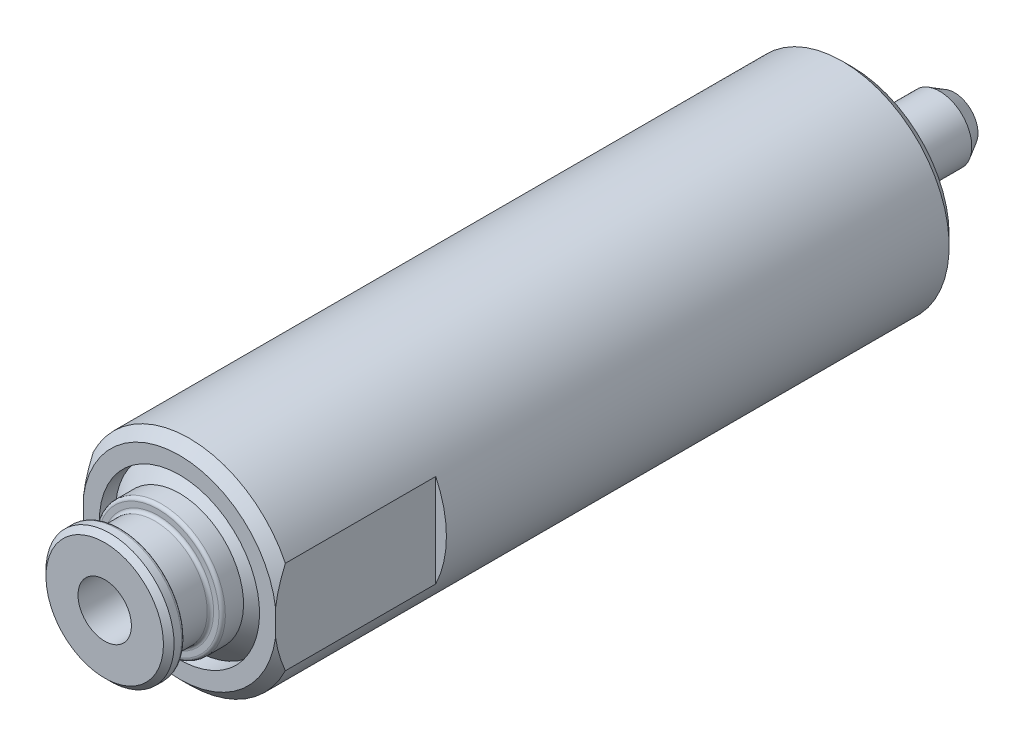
ISO-10303-21;
HEADER;
FILE_DESCRIPTION(('STEP AP214'),'2;1');
FILE_NAME('part.step','',(''),(''),'','','');
FILE_SCHEMA(('AUTOMOTIVE_DESIGN { 1 0 10303 214 1 1 1 1 }'));
ENDSEC;
DATA;
#1=APPLICATION_CONTEXT('core data for automotive mechanical design processes');
#2=APPLICATION_PROTOCOL_DEFINITION('international standard','automotive_design',2000,#1);
#3=PRODUCT_CONTEXT('',#1,'mechanical');
#4=PRODUCT('Part','Part','',(#3));
#5=PRODUCT_RELATED_PRODUCT_CATEGORY('part','',(#4));
#6=PRODUCT_DEFINITION_FORMATION('','',#4);
#7=PRODUCT_DEFINITION_CONTEXT('part definition',#1,'design');
#8=PRODUCT_DEFINITION('design','',#6,#7);
#9=PRODUCT_DEFINITION_SHAPE('','',#8);
#10=(LENGTH_UNIT() NAMED_UNIT(*) SI_UNIT(.MILLI.,.METRE.));
#11=(NAMED_UNIT(*) PLANE_ANGLE_UNIT() SI_UNIT($,.RADIAN.));
#12=(NAMED_UNIT(*) SI_UNIT($,.STERADIAN.) SOLID_ANGLE_UNIT());
#13=UNCERTAINTY_MEASURE_WITH_UNIT(LENGTH_MEASURE(1.E-05),#10,'distance_accuracy_value','');
#14=(GEOMETRIC_REPRESENTATION_CONTEXT(3) GLOBAL_UNCERTAINTY_ASSIGNED_CONTEXT((#13)) GLOBAL_UNIT_ASSIGNED_CONTEXT((#10,
#11,#12)) REPRESENTATION_CONTEXT('',''));
#15=CARTESIAN_POINT('',(0.,0.,0.));
#16=DIRECTION('',(0.,0.,1.));
#17=DIRECTION('',(1.,0.,0.));
#18=AXIS2_PLACEMENT_3D('',#15,#16,#17);
#19=CARTESIAN_POINT('',(0.,0.,3.));
#20=DIRECTION('',(0.,0.,-1.));
#21=DIRECTION('',(-0.500513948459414,-0.865728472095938,0.));
#22=AXIS2_PLACEMENT_3D('',#19,#20,#21);
#23=CYLINDRICAL_SURFACE('',#22,3.);
#24=CARTESIAN_POINT('',(0.,0.,-8.2));
#25=DIRECTION('',(0.,0.,1.));
#26=DIRECTION('',(0.500513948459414,0.865728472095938,0.));
#27=AXIS2_PLACEMENT_3D('',#24,#25,#26);
#28=CIRCLE('',#27,3.);
#29=CARTESIAN_POINT('',(1.50154184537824,2.59718541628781,-8.2));
#30=VERTEX_POINT('',#29);
#31=EDGE_CURVE('E23',#30,#30,#28,.T.);
#32=ORIENTED_EDGE('',*,*,#31,.T.);
#33=EDGE_LOOP('',(#32));
#34=FACE_BOUND('',#33,.T.);
#35=CARTESIAN_POINT('',(0.,0.,0.));
#36=DIRECTION('',(0.,0.,1.));
#37=DIRECTION('',(0.500513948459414,0.865728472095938,0.));
#38=AXIS2_PLACEMENT_3D('',#35,#36,#37);
#39=CIRCLE('',#38,3.);
#40=CARTESIAN_POINT('',(1.50154184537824,2.59718541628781,0.));
#41=VERTEX_POINT('',#40);
#42=EDGE_CURVE('E108',#41,#41,#39,.T.);
#43=ORIENTED_EDGE('',*,*,#42,.F.);
#44=EDGE_LOOP('',(#43));
#45=FACE_BOUND('',#44,.T.);
#46=ADVANCED_FACE('F14',(#34,#45),#23,.T.);
#47=CARTESIAN_POINT('',(0.,0.,-4.));
#48=DIRECTION('',(0.,0.,-1.));
#49=DIRECTION('',(-0.500513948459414,-0.865728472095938,0.));
#50=AXIS2_PLACEMENT_3D('',#47,#48,#49);
#51=SPHERICAL_SURFACE('',#50,6.);
#52=CARTESIAN_POINT('',(0.,0.,-9.58107460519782));
#53=DIRECTION('',(0.,0.,-1.));
#54=DIRECTION('',(-0.865728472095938,0.500513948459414,0.));
#55=AXIS2_PLACEMENT_3D('',#52,#53,#54);
#56=CIRCLE('',#55,2.20263620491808);
#57=CARTESIAN_POINT('',(-1.90688487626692,1.10245014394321,-9.58107460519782));
#58=VERTEX_POINT('',#57);
#59=EDGE_CURVE('E9',#58,#58,#56,.T.);
#60=ORIENTED_EDGE('',*,*,#59,.T.);
#61=EDGE_LOOP('',(#60));
#62=FACE_BOUND('',#61,.T.);
#63=ADVANCED_FACE('F233',(#62),#51,.T.);
#64=CARTESIAN_POINT('',(0.,0.,-8.2));
#65=DIRECTION('',(0.,0.,1.));
#66=DIRECTION('',(0.865728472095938,-0.500513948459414,0.));
#67=AXIS2_PLACEMENT_3D('',#64,#65,#66);
#68=CONICAL_SURFACE('',#67,3.,0.523598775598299);
#69=ORIENTED_EDGE('',*,*,#59,.F.);
#70=EDGE_LOOP('',(#69));
#71=FACE_BOUND('',#70,.T.);
#72=ORIENTED_EDGE('',*,*,#31,.F.);
#73=EDGE_LOOP('',(#72));
#74=FACE_BOUND('',#73,.T.);
#75=ADVANCED_FACE('F222',(#71,#74),#68,.T.);
#76=CARTESIAN_POINT('',(2.067,0.,70.));
#77=DIRECTION('',(0.,0.,-1.));
#78=DIRECTION('',(0.,1.,0.));
#79=AXIS2_PLACEMENT_3D('',#76,#77,#78);
#80=PLANE('',#79);
#81=CARTESIAN_POINT('',(0.,0.,70.));
#82=DIRECTION('',(0.,0.,1.));
#83=DIRECTION('',(1.,0.,0.));
#84=AXIS2_PLACEMENT_3D('',#81,#82,#83);
#85=CIRCLE('',#84,2.5);
#86=CARTESIAN_POINT('',(2.5,0.,70.));
#87=VERTEX_POINT('',#86);
#88=EDGE_CURVE('E252',#87,#87,#85,.T.);
#89=ORIENTED_EDGE('',*,*,#88,.F.);
#90=EDGE_LOOP('',(#89));
#91=FACE_BOUND('',#90,.T.);
#92=CARTESIAN_POINT('',(0.,0.,70.));
#93=DIRECTION('',(0.,0.,-1.));
#94=DIRECTION('',(0.,1.,0.));
#95=AXIS2_PLACEMENT_3D('',#92,#93,#94);
#96=CIRCLE('',#95,5.5);
#97=CARTESIAN_POINT('',(0.,5.5,70.));
#98=VERTEX_POINT('',#97);
#99=EDGE_CURVE('E154',#98,#98,#96,.T.);
#100=ORIENTED_EDGE('',*,*,#99,.F.);
#101=EDGE_LOOP('',(#100));
#102=FACE_BOUND('',#101,.T.);
#103=ADVANCED_FACE('F212',(#91,#102),#80,.F.);
#104=CARTESIAN_POINT('',(0.,0.,70.));
#105=DIRECTION('',(0.,0.,-1.));
#106=DIRECTION('',(0.,1.,0.));
#107=AXIS2_PLACEMENT_3D('',#104,#105,#106);
#108=CONICAL_SURFACE('',#107,5.5,0.785398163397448);
#109=CARTESIAN_POINT('',(0.,0.,69.5));
#110=DIRECTION('',(0.,0.,-1.));
#111=DIRECTION('',(0.,1.,0.));
#112=AXIS2_PLACEMENT_3D('',#109,#110,#111);
#113=CIRCLE('',#112,6.);
#114=CARTESIAN_POINT('',(0.,6.,69.5));
#115=VERTEX_POINT('',#114);
#116=EDGE_CURVE('E151',#115,#115,#113,.T.);
#117=ORIENTED_EDGE('',*,*,#116,.F.);
#118=EDGE_LOOP('',(#117));
#119=FACE_BOUND('',#118,.T.);
#120=ORIENTED_EDGE('',*,*,#99,.T.);
#121=EDGE_LOOP('',(#120));
#122=FACE_BOUND('',#121,.T.);
#123=ADVANCED_FACE('F221',(#119,#122),#108,.T.);
#124=CARTESIAN_POINT('',(0.,0.,47.5));
#125=DIRECTION('',(0.,0.,-1.));
#126=DIRECTION('',(0.,1.,0.));
#127=AXIS2_PLACEMENT_3D('',#124,#125,#126);
#128=CYLINDRICAL_SURFACE('',#127,6.);
#129=CARTESIAN_POINT('',(0.,0.,68.8));
#130=DIRECTION('',(0.,0.,-1.));
#131=DIRECTION('',(0.,1.,0.));
#132=AXIS2_PLACEMENT_3D('',#129,#130,#131);
#133=CIRCLE('',#132,6.);
#134=CARTESIAN_POINT('',(0.,6.,68.8));
#135=VERTEX_POINT('',#134);
#136=EDGE_CURVE('E148',#135,#135,#133,.T.);
#137=ORIENTED_EDGE('',*,*,#136,.F.);
#138=EDGE_LOOP('',(#137));
#139=FACE_BOUND('',#138,.T.);
#140=ORIENTED_EDGE('',*,*,#116,.T.);
#141=EDGE_LOOP('',(#140));
#142=FACE_BOUND('',#141,.T.);
#143=ADVANCED_FACE('F230',(#139,#142),#128,.T.);
#144=CARTESIAN_POINT('',(0.,0.,68.8));
#145=DIRECTION('',(0.,0.,-1.));
#146=DIRECTION('',(0.,1.,0.));
#147=AXIS2_PLACEMENT_3D('',#144,#145,#146);
#148=TOROIDAL_SURFACE('',#147,5.7,0.299999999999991);
#149=ORIENTED_EDGE('',*,*,#136,.T.);
#150=EDGE_LOOP('',(#149));
#151=FACE_BOUND('',#150,.T.);
#152=CARTESIAN_POINT('',(0.,0.,68.5));
#153=DIRECTION('',(0.,0.,-1.));
#154=DIRECTION('',(0.,1.,0.));
#155=AXIS2_PLACEMENT_3D('',#152,#153,#154);
#156=CIRCLE('',#155,5.7);
#157=CARTESIAN_POINT('',(0.,5.7,68.5));
#158=VERTEX_POINT('',#157);
#159=EDGE_CURVE('E145',#158,#158,#156,.T.);
#160=ORIENTED_EDGE('',*,*,#159,.F.);
#161=EDGE_LOOP('',(#160));
#162=FACE_BOUND('',#161,.T.);
#163=ADVANCED_FACE('F296',(#151,#162),#148,.T.);
#164=CARTESIAN_POINT('',(5.7,0.,68.5));
#165=DIRECTION('',(0.,0.,1.));
#166=DIRECTION('',(0.,-1.,0.));
#167=AXIS2_PLACEMENT_3D('',#164,#165,#166);
#168=PLANE('',#167);
#169=CARTESIAN_POINT('',(0.,0.,68.5));
#170=DIRECTION('',(0.,0.,-1.));
#171=DIRECTION('',(0.,1.,0.));
#172=AXIS2_PLACEMENT_3D('',#169,#170,#171);
#173=CIRCLE('',#172,5.2);
#174=CARTESIAN_POINT('',(0.,5.2,68.5));
#175=VERTEX_POINT('',#174);
#176=EDGE_CURVE('E142',#175,#175,#173,.T.);
#177=ORIENTED_EDGE('',*,*,#176,.F.);
#178=EDGE_LOOP('',(#177));
#179=FACE_BOUND('',#178,.T.);
#180=ORIENTED_EDGE('',*,*,#159,.T.);
#181=EDGE_LOOP('',(#180));
#182=FACE_BOUND('',#181,.T.);
#183=ADVANCED_FACE('F292',(#179,#182),#168,.F.);
#184=CARTESIAN_POINT('',(0.,0.,68.2));
#185=DIRECTION('',(0.,0.,-1.));
#186=DIRECTION('',(0.,1.,0.));
#187=AXIS2_PLACEMENT_3D('',#184,#185,#186);
#188=TOROIDAL_SURFACE('',#187,5.2,0.300000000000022);
#189=CARTESIAN_POINT('',(0.,0.,68.2));
#190=DIRECTION('',(0.,0.,-1.));
#191=DIRECTION('',(0.,1.,0.));
#192=AXIS2_PLACEMENT_3D('',#189,#190,#191);
#193=CIRCLE('',#192,4.9);
#194=CARTESIAN_POINT('',(0.,4.9,68.2));
#195=VERTEX_POINT('',#194);
#196=EDGE_CURVE('E139',#195,#195,#193,.T.);
#197=ORIENTED_EDGE('',*,*,#196,.F.);
#198=EDGE_LOOP('',(#197));
#199=FACE_BOUND('',#198,.T.);
#200=ORIENTED_EDGE('',*,*,#176,.T.);
#201=EDGE_LOOP('',(#200));
#202=FACE_BOUND('',#201,.T.);
#203=ADVANCED_FACE('F288',(#199,#202),#188,.F.);
#204=CARTESIAN_POINT('',(0.,0.,47.5));
#205=DIRECTION('',(0.,0.,-1.));
#206=DIRECTION('',(0.,1.,0.));
#207=AXIS2_PLACEMENT_3D('',#204,#205,#206);
#208=CYLINDRICAL_SURFACE('',#207,4.9);
#209=CARTESIAN_POINT('',(0.,0.,65.3));
#210=DIRECTION('',(0.,0.,-1.));
#211=DIRECTION('',(0.,1.,0.));
#212=AXIS2_PLACEMENT_3D('',#209,#210,#211);
#213=CIRCLE('',#212,4.9);
#214=CARTESIAN_POINT('',(0.,4.9,65.3));
#215=VERTEX_POINT('',#214);
#216=EDGE_CURVE('E136',#215,#215,#213,.T.);
#217=ORIENTED_EDGE('',*,*,#216,.F.);
#218=EDGE_LOOP('',(#217));
#219=FACE_BOUND('',#218,.T.);
#220=ORIENTED_EDGE('',*,*,#196,.T.);
#221=EDGE_LOOP('',(#220));
#222=FACE_BOUND('',#221,.T.);
#223=ADVANCED_FACE('F284',(#219,#222),#208,.T.);
#224=CARTESIAN_POINT('',(0.,0.,65.3));
#225=DIRECTION('',(0.,0.,-1.));
#226=DIRECTION('',(0.,1.,0.));
#227=AXIS2_PLACEMENT_3D('',#224,#225,#226);
#228=TOROIDAL_SURFACE('',#227,5.2,0.300000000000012);
#229=CARTESIAN_POINT('',(0.,0.,65.));
#230=DIRECTION('',(0.,0.,-1.));
#231=DIRECTION('',(0.,1.,0.));
#232=AXIS2_PLACEMENT_3D('',#229,#230,#231);
#233=CIRCLE('',#232,5.2);
#234=CARTESIAN_POINT('',(0.,5.2,65.));
#235=VERTEX_POINT('',#234);
#236=EDGE_CURVE('E133',#235,#235,#233,.T.);
#237=ORIENTED_EDGE('',*,*,#236,.F.);
#238=EDGE_LOOP('',(#237));
#239=FACE_BOUND('',#238,.T.);
#240=ORIENTED_EDGE('',*,*,#216,.T.);
#241=EDGE_LOOP('',(#240));
#242=FACE_BOUND('',#241,.T.);
#243=ADVANCED_FACE('F280',(#239,#242),#228,.F.);
#244=CARTESIAN_POINT('',(5.2,0.,65.));
#245=DIRECTION('',(0.,0.,-1.));
#246=DIRECTION('',(0.,1.,0.));
#247=AXIS2_PLACEMENT_3D('',#244,#245,#246);
#248=PLANE('',#247);
#249=CARTESIAN_POINT('',(0.,0.,65.));
#250=DIRECTION('',(0.,0.,-1.));
#251=DIRECTION('',(0.,1.,0.));
#252=AXIS2_PLACEMENT_3D('',#249,#250,#251);
#253=CIRCLE('',#252,5.7);
#254=CARTESIAN_POINT('',(0.,5.7,65.));
#255=VERTEX_POINT('',#254);
#256=EDGE_CURVE('E130',#255,#255,#253,.T.);
#257=ORIENTED_EDGE('',*,*,#256,.F.);
#258=EDGE_LOOP('',(#257));
#259=FACE_BOUND('',#258,.T.);
#260=ORIENTED_EDGE('',*,*,#236,.T.);
#261=EDGE_LOOP('',(#260));
#262=FACE_BOUND('',#261,.T.);
#263=ADVANCED_FACE('F276',(#259,#262),#248,.F.);
#264=CARTESIAN_POINT('',(0.,0.,64.7));
#265=DIRECTION('',(0.,0.,-1.));
#266=DIRECTION('',(0.,1.,0.));
#267=AXIS2_PLACEMENT_3D('',#264,#265,#266);
#268=TOROIDAL_SURFACE('',#267,5.7,0.300000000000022);
#269=ORIENTED_EDGE('',*,*,#256,.T.);
#270=EDGE_LOOP('',(#269));
#271=FACE_BOUND('',#270,.T.);
#272=CARTESIAN_POINT('',(0.,0.,64.7));
#273=DIRECTION('',(0.,0.,-1.));
#274=DIRECTION('',(0.,1.,0.));
#275=AXIS2_PLACEMENT_3D('',#272,#273,#274);
#276=CIRCLE('',#275,6.);
#277=CARTESIAN_POINT('',(0.,6.,64.7));
#278=VERTEX_POINT('',#277);
#279=EDGE_CURVE('E127',#278,#278,#276,.T.);
#280=ORIENTED_EDGE('',*,*,#279,.F.);
#281=EDGE_LOOP('',(#280));
#282=FACE_BOUND('',#281,.T.);
#283=ADVANCED_FACE('F272',(#271,#282),#268,.T.);
#284=CARTESIAN_POINT('',(0.,0.,47.5));
#285=DIRECTION('',(0.,0.,-1.));
#286=DIRECTION('',(0.,1.,0.));
#287=AXIS2_PLACEMENT_3D('',#284,#285,#286);
#288=CYLINDRICAL_SURFACE('',#287,6.);
#289=CARTESIAN_POINT('',(0.,0.,63.));
#290=DIRECTION('',(0.,0.,-1.));
#291=DIRECTION('',(0.,1.,0.));
#292=AXIS2_PLACEMENT_3D('',#289,#290,#291);
#293=CIRCLE('',#292,6.);
#294=CARTESIAN_POINT('',(0.,6.,63.));
#295=VERTEX_POINT('',#294);
#296=EDGE_CURVE('E124',#295,#295,#293,.T.);
#297=ORIENTED_EDGE('',*,*,#296,.F.);
#298=EDGE_LOOP('',(#297));
#299=FACE_BOUND('',#298,.T.);
#300=ORIENTED_EDGE('',*,*,#279,.T.);
#301=EDGE_LOOP('',(#300));
#302=FACE_BOUND('',#301,.T.);
#303=ADVANCED_FACE('F268',(#299,#302),#288,.T.);
#304=CARTESIAN_POINT('',(0.,0.,63.));
#305=DIRECTION('',(0.,0.,-1.));
#306=DIRECTION('',(0.,1.,0.));
#307=AXIS2_PLACEMENT_3D('',#304,#305,#306);
#308=CONICAL_SURFACE('',#307,6.,0.785398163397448);
#309=CARTESIAN_POINT('',(0.,0.,61.5));
#310=DIRECTION('',(0.,0.,-1.));
#311=DIRECTION('',(0.,1.,0.));
#312=AXIS2_PLACEMENT_3D('',#309,#310,#311);
#313=CIRCLE('',#312,7.5);
#314=CARTESIAN_POINT('',(0.,7.5,61.5));
#315=VERTEX_POINT('',#314);
#316=EDGE_CURVE('E121',#315,#315,#313,.T.);
#317=ORIENTED_EDGE('',*,*,#316,.F.);
#318=EDGE_LOOP('',(#317));
#319=FACE_BOUND('',#318,.T.);
#320=ORIENTED_EDGE('',*,*,#296,.T.);
#321=EDGE_LOOP('',(#320));
#322=FACE_BOUND('',#321,.T.);
#323=ADVANCED_FACE('F184',(#319,#322),#308,.T.);
#324=CARTESIAN_POINT('',(0.,0.,0.));
#325=DIRECTION('',(0.,0.,-1.));
#326=DIRECTION('',(0.,1.,0.));
#327=AXIS2_PLACEMENT_3D('',#324,#325,#326);
#328=CYLINDRICAL_SURFACE('',#327,7.5);
#329=ORIENTED_EDGE('',*,*,#316,.T.);
#330=EDGE_LOOP('',(#329));
#331=FACE_BOUND('',#330,.T.);
#332=CARTESIAN_POINT('',(0.,0.,63.));
#333=DIRECTION('',(0.,0.,-1.));
#334=DIRECTION('',(0.,1.,0.));
#335=AXIS2_PLACEMENT_3D('',#332,#333,#334);
#336=CIRCLE('',#335,7.5);
#337=CARTESIAN_POINT('',(0.,7.5,63.));
#338=VERTEX_POINT('',#337);
#339=EDGE_CURVE('E95',#338,#338,#336,.T.);
#340=ORIENTED_EDGE('',*,*,#339,.F.);
#341=EDGE_LOOP('',(#340));
#342=FACE_BOUND('',#341,.T.);
#343=ADVANCED_FACE('F182',(#331,#342),#328,.F.);
#344=CARTESIAN_POINT('',(9.08,0.,63.));
#345=DIRECTION('',(0.,0.,1.));
#346=DIRECTION('',(0.,-1.,0.));
#347=AXIS2_PLACEMENT_3D('',#344,#345,#346);
#348=PLANE('',#347);
#349=ORIENTED_EDGE('',*,*,#339,.T.);
#350=EDGE_LOOP('',(#349));
#351=FACE_BOUND('',#350,.T.);
#352=CARTESIAN_POINT('',(0.,0.,63.));
#353=DIRECTION('',(0.,0.,-1.));
#354=DIRECTION('',(0.,1.,0.));
#355=AXIS2_PLACEMENT_3D('',#352,#353,#354);
#356=CIRCLE('',#355,9.08);
#357=CARTESIAN_POINT('',(-9.,1.20266371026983,63.));
#358=VERTEX_POINT('',#357);
#359=CARTESIAN_POINT('',(9.,1.20266371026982,63.));
#360=VERTEX_POINT('',#359);
#361=EDGE_CURVE('E92',#358,#360,#356,.T.);
#362=ORIENTED_EDGE('',*,*,#361,.F.);
#363=DIRECTION('',(0.,-1.,0.));
#364=VECTOR('',#363,1.);
#365=CARTESIAN_POINT('',(-9.,0.,63.));
#366=LINE('',#365,#364);
#367=CARTESIAN_POINT('',(-9.,-1.20266371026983,63.));
#368=VERTEX_POINT('',#367);
#369=EDGE_CURVE('E78',#358,#368,#366,.T.);
#370=ORIENTED_EDGE('',*,*,#369,.T.);
#371=CARTESIAN_POINT('',(9.,-1.20266371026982,63.));
#372=VERTEX_POINT('',#371);
#373=EDGE_CURVE('E85',#372,#368,#356,.T.);
#374=ORIENTED_EDGE('',*,*,#373,.F.);
#375=DIRECTION('',(0.,1.,0.));
#376=VECTOR('',#375,1.);
#377=CARTESIAN_POINT('',(9.,0.,63.));
#378=LINE('',#377,#376);
#379=EDGE_CURVE('E68',#372,#360,#378,.T.);
#380=ORIENTED_EDGE('',*,*,#379,.T.);
#381=EDGE_LOOP('',(#362,#370,#374,#380));
#382=FACE_BOUND('',#381,.T.);
#383=ADVANCED_FACE('F90',(#351,#382),#348,.T.);
#384=CARTESIAN_POINT('',(0.,0.,62.08));
#385=DIRECTION('',(0.,0.,-1.));
#386=DIRECTION('',(0.,1.,0.));
#387=AXIS2_PLACEMENT_3D('',#384,#385,#386);
#388=CONICAL_SURFACE('',#387,10.,0.785398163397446);
#389=CARTESIAN_POINT('',(0.,0.,62.08));
#390=DIRECTION('',(0.,0.,-1.));
#391=DIRECTION('',(0.,1.,0.));
#392=AXIS2_PLACEMENT_3D('',#389,#390,#391);
#393=CIRCLE('',#392,10.);
#394=CARTESIAN_POINT('',(-9.,4.35889894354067,62.08));
#395=VERTEX_POINT('',#394);
#396=CARTESIAN_POINT('',(9.,4.35889894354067,62.08));
#397=VERTEX_POINT('',#396);
#398=EDGE_CURVE('E91',#395,#397,#393,.T.);
#399=ORIENTED_EDGE('',*,*,#398,.F.);
#400=CARTESIAN_POINT('',(-9.,20.0889844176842,50.0671107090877));
#401=CARTESIAN_POINT('',(-9.,19.7941845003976,50.3361376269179));
#402=CARTESIAN_POINT('',(-9.,19.49889874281,50.6046332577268));
#403=CARTESIAN_POINT('',(-9.,18.9072134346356,51.1403994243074));
#404=CARTESIAN_POINT('',(-9.,18.6108138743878,51.4076699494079));
#405=CARTESIAN_POINT('',(-9.,18.016689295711,51.9408857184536));
#406=CARTESIAN_POINT('',(-9.,17.7189639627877,52.2068306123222));
#407=CARTESIAN_POINT('',(-9.,17.1220890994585,52.7371142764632));
#408=CARTESIAN_POINT('',(-9.,16.822939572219,53.0014530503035));
#409=CARTESIAN_POINT('',(-9.,15.9186985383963,53.7955547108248));
#410=CARTESIAN_POINT('',(-9.,15.3111326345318,54.3225158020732));
#411=CARTESIAN_POINT('',(-9.,14.3932925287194,55.1052669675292));
#412=CARTESIAN_POINT('',(-9.,14.0862824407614,55.3648870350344));
#413=CARTESIAN_POINT('',(-9.,13.4697157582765,55.881088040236));
#414=CARTESIAN_POINT('',(-9.,13.1601591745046,56.1376689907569));
#415=CARTESIAN_POINT('',(-9.,12.5849192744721,56.6088254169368));
#416=CARTESIAN_POINT('',(-9.,12.3196505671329,56.8239068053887));
#417=CARTESIAN_POINT('',(-9.,11.7866455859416,57.2509886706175));
#418=CARTESIAN_POINT('',(-9.,11.5189093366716,57.4629891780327));
#419=CARTESIAN_POINT('',(-9.,10.9804995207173,57.8834133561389));
#420=CARTESIAN_POINT('',(-9.,10.7098250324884,58.0918358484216));
#421=CARTESIAN_POINT('',(-9.,10.165171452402,58.5043204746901));
#422=CARTESIAN_POINT('',(-9.,9.89119239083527,58.7083826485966));
#423=CARTESIAN_POINT('',(-9.,9.33978293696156,59.1109565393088));
#424=CARTESIAN_POINT('',(-9.,9.06235809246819,59.309475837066));
#425=CARTESIAN_POINT('',(-9.,8.50301529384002,59.7001296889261));
#426=CARTESIAN_POINT('',(-9.,8.22109712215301,59.8922639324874));
#427=CARTESIAN_POINT('',(-9.,7.65217834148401,60.2685512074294));
#428=CARTESIAN_POINT('',(-9.,7.36518050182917,60.4527084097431));
#429=CARTESIAN_POINT('',(-9.,6.78513344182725,60.8111918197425));
#430=CARTESIAN_POINT('',(-9.,6.49208508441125,60.9855194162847));
#431=CARTESIAN_POINT('',(-9.,5.90679788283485,61.317393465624));
#432=CARTESIAN_POINT('',(-9.,5.6147426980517,61.4752618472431));
#433=CARTESIAN_POINT('',(-9.,5.02305416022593,61.7763015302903));
#434=CARTESIAN_POINT('',(-9.,4.72342010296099,61.9194714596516));
#435=CARTESIAN_POINT('',(-9.,4.11636189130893,62.1870563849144));
#436=CARTESIAN_POINT('',(-9.,3.80895049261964,62.3115000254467));
#437=CARTESIAN_POINT('',(-9.,3.18569208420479,62.5372331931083));
#438=CARTESIAN_POINT('',(-9.,2.86984745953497,62.6385291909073));
#439=CARTESIAN_POINT('',(-9.,2.29142781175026,62.7962123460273));
#440=CARTESIAN_POINT('',(-9.,2.03019136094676,62.8574808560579));
#441=CARTESIAN_POINT('',(-9.,1.50362674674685,62.958913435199));
#442=CARTESIAN_POINT('',(-9.,1.23829917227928,62.9990805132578));
#443=CARTESIAN_POINT('',(-9.,0.705706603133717,63.0562472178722));
#444=CARTESIAN_POINT('',(-9.,0.438447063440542,63.0732969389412));
#445=CARTESIAN_POINT('',(-9.,-0.0965355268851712,63.0834560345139));
#446=CARTESIAN_POINT('',(-9.,-0.364258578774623,63.0765653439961));
#447=CARTESIAN_POINT('',(-9.,-0.897547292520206,63.03926235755));
#448=CARTESIAN_POINT('',(-9.,-1.16311598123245,63.0088926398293));
#449=CARTESIAN_POINT('',(-9.,-1.69079838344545,62.9262664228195));
#450=CARTESIAN_POINT('',(-9.,-1.9529118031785,62.8740080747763));
#451=CARTESIAN_POINT('',(-9.,-2.47314253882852,62.7498122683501));
#452=CARTESIAN_POINT('',(-9.,-2.73124679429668,62.6778207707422));
#453=CARTESIAN_POINT('',(-9.,-3.24205693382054,62.516938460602));
#454=CARTESIAN_POINT('',(-9.,-3.49476303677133,62.4280483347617));
#455=CARTESIAN_POINT('',(-9.,-4.07604409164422,62.2047542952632));
#456=CARTESIAN_POINT('',(-9.,-4.40253716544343,62.0649539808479));
#457=CARTESIAN_POINT('',(-9.,-5.04645154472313,61.7656734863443));
#458=CARTESIAN_POINT('',(-9.,-5.36386785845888,61.6061827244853));
#459=CARTESIAN_POINT('',(-9.,-5.99110227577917,61.271539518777));
#460=CARTESIAN_POINT('',(-9.,-6.30090358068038,61.0963558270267));
#461=CARTESIAN_POINT('',(-9.,-6.91327229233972,60.7339678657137));
#462=CARTESIAN_POINT('',(-9.,-7.21584094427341,60.5467656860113));
#463=CARTESIAN_POINT('',(-9.,-7.81811190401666,60.1607348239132));
#464=CARTESIAN_POINT('',(-9.,-8.11774682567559,59.961801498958));
#465=CARTESIAN_POINT('',(-9.,-8.71169811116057,59.5561568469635));
#466=CARTESIAN_POINT('',(-9.,-9.00601430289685,59.3494452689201));
#467=CARTESIAN_POINT('',(-9.,-9.58977868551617,58.9299922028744));
#468=CARTESIAN_POINT('',(-9.,-9.87923221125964,58.7172581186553));
#469=CARTESIAN_POINT('',(-9.,-10.4543036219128,58.2866619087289));
#470=CARTESIAN_POINT('',(-9.,-10.7399213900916,58.0687996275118));
#471=CARTESIAN_POINT('',(-9.,-11.4242974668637,57.5386678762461));
#472=CARTESIAN_POINT('',(-9.,-11.8214368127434,57.2243100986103));
#473=CARTESIAN_POINT('',(-9.,-12.6104586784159,56.5890670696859));
#474=CARTESIAN_POINT('',(-9.,-13.0023410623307,56.268181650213));
#475=CARTESIAN_POINT('',(-9.,-13.7819938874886,55.6210793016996));
#476=CARTESIAN_POINT('',(-9.,-14.1697622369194,55.2948598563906));
#477=CARTESIAN_POINT('',(-9.,-14.9417496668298,54.6382482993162));
#478=CARTESIAN_POINT('',(-9.,-15.3259687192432,54.3078561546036));
#479=CARTESIAN_POINT('',(-9.,-16.0783900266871,53.6549933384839));
#480=CARTESIAN_POINT('',(-9.,-16.4466915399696,53.3326369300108));
#481=CARTESIAN_POINT('',(-9.,-17.1809601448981,52.6852740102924));
#482=CARTESIAN_POINT('',(-9.,-17.5469272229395,52.3602674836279));
#483=CARTESIAN_POINT('',(-9.,-18.2765566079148,51.7083120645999));
#484=CARTESIAN_POINT('',(-9.,-18.6402206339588,51.3813650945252));
#485=CARTESIAN_POINT('',(-9.,-19.3658255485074,50.725578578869));
#486=CARTESIAN_POINT('',(-9.,-19.7277664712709,50.3967390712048));
#487=CARTESIAN_POINT('',(-9.,-20.0889844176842,50.0671107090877));
#488=B_SPLINE_CURVE_WITH_KNOTS('',3,(#400,#401,#402,#403,#404,#405,#406,#407,#408,#409,#410,
#411,#412,#413,#414,#415,#416,#417,#418,#419,#420,#421,#422,#423,#424,#425,#426,#427,#428,#429,
#430,#431,#432,#433,#434,#435,#436,#437,#438,#439,#440,#441,#442,#443,#444,#445,#446,#447,#448,
#449,#450,#451,#452,#453,#454,#455,#456,#457,#458,#459,#460,#461,#462,#463,#464,#465,#466,#467,
#468,#469,#470,#471,#472,#473,#474,#475,#476,#477,#478,#479,#480,#481,#482,#483,#484,#485,#486,
#487),.UNSPECIFIED.,.F.,.F.,(4,2,2,2,2,2,2,2,2,2,2,2,2,2,2,2,2,2,2,2,2,2,2,2,2,2,2,2,2,2,2,2,2,
2,2,2,2,2,2,2,2,2,2,4),(0.,1.19730659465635,2.3946235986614,3.59224161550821,4.78985697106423,
7.20251667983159,8.40870278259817,9.61488379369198,10.6393878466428,11.6638817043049,
12.6887067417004,13.7135223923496,14.7368599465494,15.7602471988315,16.7830927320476,
17.8057933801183,18.8014398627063,19.7971792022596,20.7913795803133,21.7853016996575,
22.5895213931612,23.3936263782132,24.195986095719,24.9983479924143,25.7992582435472,
26.6002361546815,27.4034298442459,28.2065909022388,29.2712072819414,30.3363983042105,
31.403759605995,32.4709358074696,33.5497661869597,34.6286314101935,35.7062234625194,
36.7838482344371,38.3032478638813,39.8226866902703,41.3428642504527,42.8630538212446,
44.3313839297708,45.7997225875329,47.2667917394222,48.7338316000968),.UNSPECIFIED.);
#489=EDGE_CURVE('E199',#395,#358,#488,.T.);
#490=ORIENTED_EDGE('',*,*,#489,.T.);
#491=ORIENTED_EDGE('',*,*,#361,.T.);
#492=CARTESIAN_POINT('',(9.,-20.0889844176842,50.0671107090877));
#493=CARTESIAN_POINT('',(9.,-19.7941845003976,50.3361376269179));
#494=CARTESIAN_POINT('',(9.,-19.49889874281,50.6046332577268));
#495=CARTESIAN_POINT('',(9.,-18.9072134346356,51.1403994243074));
#496=CARTESIAN_POINT('',(9.,-18.6108138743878,51.4076699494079));
#497=CARTESIAN_POINT('',(9.,-18.016689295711,51.9408857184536));
#498=CARTESIAN_POINT('',(9.,-17.7189639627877,52.2068306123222));
#499=CARTESIAN_POINT('',(9.,-17.1220890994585,52.7371142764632));
#500=CARTESIAN_POINT('',(9.,-16.822939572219,53.0014530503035));
#501=CARTESIAN_POINT('',(9.,-15.9186985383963,53.7955547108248));
#502=CARTESIAN_POINT('',(9.,-15.3111326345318,54.3225158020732));
#503=CARTESIAN_POINT('',(9.,-14.3932925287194,55.1052669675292));
#504=CARTESIAN_POINT('',(9.,-14.0862824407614,55.3648870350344));
#505=CARTESIAN_POINT('',(9.,-13.4697157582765,55.881088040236));
#506=CARTESIAN_POINT('',(9.,-13.1601591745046,56.1376689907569));
#507=CARTESIAN_POINT('',(9.,-12.5849192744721,56.6088254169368));
#508=CARTESIAN_POINT('',(9.,-12.3196505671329,56.8239068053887));
#509=CARTESIAN_POINT('',(9.,-11.7866455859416,57.2509886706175));
#510=CARTESIAN_POINT('',(9.,-11.5189093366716,57.4629891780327));
#511=CARTESIAN_POINT('',(9.,-10.9804995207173,57.8834133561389));
#512=CARTESIAN_POINT('',(9.,-10.7098250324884,58.0918358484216));
#513=CARTESIAN_POINT('',(9.,-10.165171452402,58.5043204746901));
#514=CARTESIAN_POINT('',(9.,-9.89119239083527,58.7083826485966));
#515=CARTESIAN_POINT('',(9.,-9.33978293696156,59.1109565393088));
#516=CARTESIAN_POINT('',(9.,-9.06235809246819,59.309475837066));
#517=CARTESIAN_POINT('',(9.,-8.50301529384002,59.7001296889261));
#518=CARTESIAN_POINT('',(9.,-8.22109712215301,59.8922639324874));
#519=CARTESIAN_POINT('',(9.,-7.65217834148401,60.2685512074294));
#520=CARTESIAN_POINT('',(9.,-7.36518050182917,60.4527084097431));
#521=CARTESIAN_POINT('',(9.,-6.78513344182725,60.8111918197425));
#522=CARTESIAN_POINT('',(9.,-6.49208508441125,60.9855194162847));
#523=CARTESIAN_POINT('',(9.,-5.90679788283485,61.317393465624));
#524=CARTESIAN_POINT('',(9.,-5.6147426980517,61.4752618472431));
#525=CARTESIAN_POINT('',(9.,-5.02305416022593,61.7763015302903));
#526=CARTESIAN_POINT('',(9.,-4.72342010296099,61.9194714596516));
#527=CARTESIAN_POINT('',(9.,-4.11636189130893,62.1870563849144));
#528=CARTESIAN_POINT('',(9.,-3.80895049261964,62.3115000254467));
#529=CARTESIAN_POINT('',(9.,-3.18569208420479,62.5372331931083));
#530=CARTESIAN_POINT('',(9.,-2.86984745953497,62.6385291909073));
#531=CARTESIAN_POINT('',(9.,-2.29142781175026,62.7962123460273));
#532=CARTESIAN_POINT('',(9.,-2.03019136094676,62.8574808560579));
#533=CARTESIAN_POINT('',(9.,-1.50362674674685,62.958913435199));
#534=CARTESIAN_POINT('',(9.,-1.23829917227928,62.9990805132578));
#535=CARTESIAN_POINT('',(9.,-0.705706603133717,63.0562472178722));
#536=CARTESIAN_POINT('',(9.,-0.438447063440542,63.0732969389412));
#537=CARTESIAN_POINT('',(9.,0.0965355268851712,63.0834560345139));
#538=CARTESIAN_POINT('',(9.,0.364258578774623,63.0765653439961));
#539=CARTESIAN_POINT('',(9.,0.897547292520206,63.03926235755));
#540=CARTESIAN_POINT('',(9.,1.16311598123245,63.0088926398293));
#541=CARTESIAN_POINT('',(9.,1.69079838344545,62.9262664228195));
#542=CARTESIAN_POINT('',(9.,1.9529118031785,62.8740080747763));
#543=CARTESIAN_POINT('',(9.,2.47314253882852,62.7498122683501));
#544=CARTESIAN_POINT('',(9.,2.73124679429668,62.6778207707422));
#545=CARTESIAN_POINT('',(9.,3.24205693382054,62.516938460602));
#546=CARTESIAN_POINT('',(9.,3.49476303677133,62.4280483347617));
#547=CARTESIAN_POINT('',(9.,4.07604409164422,62.2047542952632));
#548=CARTESIAN_POINT('',(9.,4.40253716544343,62.0649539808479));
#549=CARTESIAN_POINT('',(9.,5.04645154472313,61.7656734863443));
#550=CARTESIAN_POINT('',(9.,5.36386785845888,61.6061827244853));
#551=CARTESIAN_POINT('',(9.,5.99110227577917,61.271539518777));
#552=CARTESIAN_POINT('',(9.,6.30090358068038,61.0963558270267));
#553=CARTESIAN_POINT('',(9.,6.91327229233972,60.7339678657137));
#554=CARTESIAN_POINT('',(9.,7.21584094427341,60.5467656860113));
#555=CARTESIAN_POINT('',(9.,7.81811190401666,60.1607348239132));
#556=CARTESIAN_POINT('',(9.,8.11774682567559,59.961801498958));
#557=CARTESIAN_POINT('',(9.,8.71169811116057,59.5561568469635));
#558=CARTESIAN_POINT('',(9.,9.00601430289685,59.3494452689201));
#559=CARTESIAN_POINT('',(9.,9.58977868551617,58.9299922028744));
#560=CARTESIAN_POINT('',(9.,9.87923221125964,58.7172581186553));
#561=CARTESIAN_POINT('',(9.,10.4543036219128,58.2866619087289));
#562=CARTESIAN_POINT('',(9.,10.7399213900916,58.0687996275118));
#563=CARTESIAN_POINT('',(9.,11.4242974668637,57.5386678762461));
#564=CARTESIAN_POINT('',(9.,11.8214368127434,57.2243100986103));
#565=CARTESIAN_POINT('',(9.,12.6104586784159,56.5890670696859));
#566=CARTESIAN_POINT('',(9.,13.0023410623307,56.268181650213));
#567=CARTESIAN_POINT('',(9.,13.7819938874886,55.6210793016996));
#568=CARTESIAN_POINT('',(9.,14.1697622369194,55.2948598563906));
#569=CARTESIAN_POINT('',(9.,14.9417496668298,54.6382482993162));
#570=CARTESIAN_POINT('',(9.,15.3259687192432,54.3078561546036));
#571=CARTESIAN_POINT('',(9.,16.0783900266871,53.6549933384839));
#572=CARTESIAN_POINT('',(9.,16.4466915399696,53.3326369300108));
#573=CARTESIAN_POINT('',(9.,17.1809601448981,52.6852740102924));
#574=CARTESIAN_POINT('',(9.,17.5469272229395,52.3602674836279));
#575=CARTESIAN_POINT('',(9.,18.2765566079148,51.7083120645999));
#576=CARTESIAN_POINT('',(9.,18.6402206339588,51.3813650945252));
#577=CARTESIAN_POINT('',(9.,19.3658255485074,50.725578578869));
#578=CARTESIAN_POINT('',(9.,19.7277664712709,50.3967390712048));
#579=CARTESIAN_POINT('',(9.,20.0889844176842,50.0671107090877));
#580=B_SPLINE_CURVE_WITH_KNOTS('',3,(#492,#493,#494,#495,#496,#497,#498,#499,#500,#501,#502,
#503,#504,#505,#506,#507,#508,#509,#510,#511,#512,#513,#514,#515,#516,#517,#518,#519,#520,#521,
#522,#523,#524,#525,#526,#527,#528,#529,#530,#531,#532,#533,#534,#535,#536,#537,#538,#539,#540,
#541,#542,#543,#544,#545,#546,#547,#548,#549,#550,#551,#552,#553,#554,#555,#556,#557,#558,#559,
#560,#561,#562,#563,#564,#565,#566,#567,#568,#569,#570,#571,#572,#573,#574,#575,#576,#577,#578,
#579),.UNSPECIFIED.,.F.,.F.,(4,2,2,2,2,2,2,2,2,2,2,2,2,2,2,2,2,2,2,2,2,2,2,2,2,2,2,2,2,2,2,2,2,
2,2,2,2,2,2,2,2,2,2,4),(0.,1.19730659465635,2.3946235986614,3.59224161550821,4.78985697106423,
7.20251667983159,8.40870278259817,9.61488379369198,10.6393878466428,11.6638817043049,
12.6887067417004,13.7135223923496,14.7368599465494,15.7602471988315,16.7830927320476,
17.8057933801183,18.8014398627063,19.7971792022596,20.7913795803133,21.7853016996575,
22.5895213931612,23.3936263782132,24.195986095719,24.9983479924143,25.7992582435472,
26.6002361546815,27.4034298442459,28.2065909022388,29.2712072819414,30.3363983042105,
31.403759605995,32.4709358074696,33.5497661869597,34.6286314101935,35.7062234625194,
36.7838482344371,38.3032478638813,39.8226866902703,41.3428642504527,42.8630538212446,
44.3313839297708,45.7997225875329,47.2667917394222,48.7338316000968),.UNSPECIFIED.);
#581=EDGE_CURVE('E31',#360,#397,#580,.T.);
#582=ORIENTED_EDGE('',*,*,#581,.T.);
#583=EDGE_LOOP('',(#399,#490,#491,#582));
#584=FACE_BOUND('',#583,.T.);
#585=ADVANCED_FACE('F169',(#584),#388,.T.);
#586=CARTESIAN_POINT('',(0.,0.,48.));
#587=DIRECTION('',(0.,0.,1.));
#588=DIRECTION('',(0.,-1.,0.));
#589=AXIS2_PLACEMENT_3D('',#586,#587,#588);
#590=PLANE('',#589);
#591=DIRECTION('',(0.,-1.,0.));
#592=VECTOR('',#591,1.);
#593=CARTESIAN_POINT('',(-9.,10.,48.));
#594=LINE('',#593,#592);
#595=CARTESIAN_POINT('',(-9.,4.35889894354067,48.));
#596=VERTEX_POINT('',#595);
#597=CARTESIAN_POINT('',(-9.,-4.35889894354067,48.));
#598=VERTEX_POINT('',#597);
#599=EDGE_CURVE('E159',#596,#598,#594,.T.);
#600=ORIENTED_EDGE('',*,*,#599,.F.);
#601=CARTESIAN_POINT('',(0.,0.,48.));
#602=DIRECTION('',(0.,0.,1.));
#603=DIRECTION('',(0.,-1.,0.));
#604=AXIS2_PLACEMENT_3D('',#601,#602,#603);
#605=CIRCLE('',#604,10.);
#606=EDGE_CURVE('E104',#598,#596,#605,.F.);
#607=ORIENTED_EDGE('',*,*,#606,.F.);
#608=EDGE_LOOP('',(#600,#607));
#609=FACE_BOUND('',#608,.T.);
#610=ADVANCED_FACE('F193',(#609),#590,.T.);
#611=CARTESIAN_POINT('',(-9.,10.,48.));
#612=DIRECTION('',(-1.,0.,0.));
#613=DIRECTION('',(0.,-1.,0.));
#614=AXIS2_PLACEMENT_3D('',#611,#612,#613);
#615=PLANE('',#614);
#616=ORIENTED_EDGE('',*,*,#599,.T.);
#617=DIRECTION('',(0.,0.,-1.));
#618=VECTOR('',#617,1.);
#619=CARTESIAN_POINT('',(-9.,-4.35889894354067,0.));
#620=LINE('',#619,#618);
#621=CARTESIAN_POINT('',(-9.,-4.35889894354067,62.08));
#622=VERTEX_POINT('',#621);
#623=EDGE_CURVE('E202',#622,#598,#620,.T.);
#624=ORIENTED_EDGE('',*,*,#623,.F.);
#625=EDGE_CURVE('E39',#368,#622,#488,.T.);
#626=ORIENTED_EDGE('',*,*,#625,.F.);
#627=ORIENTED_EDGE('',*,*,#369,.F.);
#628=ORIENTED_EDGE('',*,*,#489,.F.);
#629=DIRECTION('',(0.,0.,-1.));
#630=VECTOR('',#629,1.);
#631=CARTESIAN_POINT('',(-9.,4.35889894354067,0.));
#632=LINE('',#631,#630);
#633=EDGE_CURVE('E198',#596,#395,#632,.F.);
#634=ORIENTED_EDGE('',*,*,#633,.F.);
#635=EDGE_LOOP('',(#616,#624,#626,#627,#628,#634));
#636=FACE_BOUND('',#635,.T.);
#637=ADVANCED_FACE('F179',(#636),#615,.T.);
#638=ORIENTED_EDGE('',*,*,#373,.T.);
#639=ORIENTED_EDGE('',*,*,#625,.T.);
#640=CARTESIAN_POINT('',(9.,-4.35889894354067,62.08));
#641=VERTEX_POINT('',#640);
#642=EDGE_CURVE('E86',#641,#622,#393,.T.);
#643=ORIENTED_EDGE('',*,*,#642,.F.);
#644=EDGE_CURVE('E72',#641,#372,#580,.T.);
#645=ORIENTED_EDGE('',*,*,#644,.T.);
#646=EDGE_LOOP('',(#638,#639,#643,#645));
#647=FACE_BOUND('',#646,.T.);
#648=ADVANCED_FACE('F84',(#647),#388,.T.);
#649=DIRECTION('',(0.,1.,0.));
#650=VECTOR('',#649,1.);
#651=CARTESIAN_POINT('',(9.,-10.,48.));
#652=LINE('',#651,#650);
#653=CARTESIAN_POINT('',(9.,-4.35889894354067,48.));
#654=VERTEX_POINT('',#653);
#655=CARTESIAN_POINT('',(9.,4.35889894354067,48.));
#656=VERTEX_POINT('',#655);
#657=EDGE_CURVE('E157',#654,#656,#652,.T.);
#658=ORIENTED_EDGE('',*,*,#657,.F.);
#659=EDGE_CURVE('E18',#656,#654,#605,.F.);
#660=ORIENTED_EDGE('',*,*,#659,.F.);
#661=EDGE_LOOP('',(#658,#660));
#662=FACE_BOUND('',#661,.T.);
#663=ADVANCED_FACE('F178',(#662),#590,.T.);
#664=CARTESIAN_POINT('',(9.,-10.,48.));
#665=DIRECTION('',(1.,0.,0.));
#666=DIRECTION('',(0.,1.,0.));
#667=AXIS2_PLACEMENT_3D('',#664,#665,#666);
#668=PLANE('',#667);
#669=ORIENTED_EDGE('',*,*,#657,.T.);
#670=DIRECTION('',(0.,0.,-1.));
#671=VECTOR('',#670,1.);
#672=CARTESIAN_POINT('',(9.,4.35889894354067,0.));
#673=LINE('',#672,#671);
#674=EDGE_CURVE('E88',#397,#656,#673,.T.);
#675=ORIENTED_EDGE('',*,*,#674,.F.);
#676=ORIENTED_EDGE('',*,*,#581,.F.);
#677=ORIENTED_EDGE('',*,*,#379,.F.);
#678=ORIENTED_EDGE('',*,*,#644,.F.);
#679=DIRECTION('',(0.,0.,-1.));
#680=VECTOR('',#679,1.);
#681=CARTESIAN_POINT('',(9.,-4.35889894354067,0.));
#682=LINE('',#681,#680);
#683=EDGE_CURVE('E87',#654,#641,#682,.F.);
#684=ORIENTED_EDGE('',*,*,#683,.F.);
#685=EDGE_LOOP('',(#669,#675,#676,#677,#678,#684));
#686=FACE_BOUND('',#685,.T.);
#687=ADVANCED_FACE('F71',(#686),#668,.T.);
#688=CARTESIAN_POINT('',(0.,0.,0.));
#689=DIRECTION('',(0.,0.,-1.));
#690=DIRECTION('',(0.,1.,0.));
#691=AXIS2_PLACEMENT_3D('',#688,#689,#690);
#692=CYLINDRICAL_SURFACE('',#691,10.);
#693=CARTESIAN_POINT('',(0.,0.,0.92));
#694=DIRECTION('',(0.,0.,-1.));
#695=DIRECTION('',(0.,1.,0.));
#696=AXIS2_PLACEMENT_3D('',#693,#694,#695);
#697=CIRCLE('',#696,10.);
#698=CARTESIAN_POINT('',(0.,10.,0.92));
#699=VERTEX_POINT('',#698);
#700=EDGE_CURVE('E99',#699,#699,#697,.T.);
#701=ORIENTED_EDGE('',*,*,#700,.F.);
#702=EDGE_LOOP('',(#701));
#703=FACE_BOUND('',#702,.T.);
#704=ORIENTED_EDGE('',*,*,#674,.T.);
#705=ORIENTED_EDGE('',*,*,#659,.T.);
#706=ORIENTED_EDGE('',*,*,#683,.T.);
#707=ORIENTED_EDGE('',*,*,#642,.T.);
#708=ORIENTED_EDGE('',*,*,#623,.T.);
#709=ORIENTED_EDGE('',*,*,#606,.T.);
#710=ORIENTED_EDGE('',*,*,#633,.T.);
#711=ORIENTED_EDGE('',*,*,#398,.T.);
#712=EDGE_LOOP('',(#704,#705,#706,#707,#708,#709,#710,#711));
#713=FACE_BOUND('',#712,.T.);
#714=ADVANCED_FACE('F177',(#703,#713),#692,.T.);
#715=CARTESIAN_POINT('',(0.,0.,0.));
#716=DIRECTION('',(0.,0.,1.));
#717=DIRECTION('',(0.,-1.,0.));
#718=AXIS2_PLACEMENT_3D('',#715,#716,#717);
#719=CONICAL_SURFACE('',#718,9.08,0.785398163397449);
#720=ORIENTED_EDGE('',*,*,#700,.T.);
#721=EDGE_LOOP('',(#720));
#722=FACE_BOUND('',#721,.T.);
#723=CARTESIAN_POINT('',(0.,0.,0.));
#724=DIRECTION('',(0.,0.,-1.));
#725=DIRECTION('',(0.,1.,0.));
#726=AXIS2_PLACEMENT_3D('',#723,#724,#725);
#727=CIRCLE('',#726,9.08);
#728=CARTESIAN_POINT('',(0.,9.08,0.));
#729=VERTEX_POINT('',#728);
#730=EDGE_CURVE('E79',#729,#729,#727,.T.);
#731=ORIENTED_EDGE('',*,*,#730,.F.);
#732=EDGE_LOOP('',(#731));
#733=FACE_BOUND('',#732,.T.);
#734=ADVANCED_FACE('F258',(#722,#733),#719,.T.);
#735=CARTESIAN_POINT('',(3.,0.,0.));
#736=DIRECTION('',(0.,0.,-1.));
#737=DIRECTION('',(0.,1.,0.));
#738=AXIS2_PLACEMENT_3D('',#735,#736,#737);
#739=PLANE('',#738);
#740=ORIENTED_EDGE('',*,*,#42,.T.);
#741=EDGE_LOOP('',(#740));
#742=FACE_BOUND('',#741,.T.);
#743=ORIENTED_EDGE('',*,*,#730,.T.);
#744=EDGE_LOOP('',(#743));
#745=FACE_BOUND('',#744,.T.);
#746=ADVANCED_FACE('F16',(#742,#745),#739,.T.);
#747=CARTESIAN_POINT('',(0.,0.,57.4289321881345));
#748=DIRECTION('',(0.,0.,1.));
#749=DIRECTION('',(1.,0.,0.));
#750=AXIS2_PLACEMENT_3D('',#747,#748,#749);
#751=CYLINDRICAL_SURFACE('',#750,2.5);
#752=ORIENTED_EDGE('',*,*,#88,.T.);
#753=EDGE_LOOP('',(#752));
#754=FACE_BOUND('',#753,.T.);
#755=CARTESIAN_POINT('',(0.,0.,64.5));
#756=DIRECTION('',(0.,0.,-1.));
#757=DIRECTION('',(-1.,0.,0.));
#758=AXIS2_PLACEMENT_3D('',#755,#756,#757);
#759=CIRCLE('',#758,2.5);
#760=CARTESIAN_POINT('',(-2.5,0.,64.5));
#761=VERTEX_POINT('',#760);
#762=EDGE_CURVE('E118',#761,#761,#759,.F.);
#763=ORIENTED_EDGE('',*,*,#762,.F.);
#764=EDGE_LOOP('',(#763));
#765=FACE_BOUND('',#764,.T.);
#766=ADVANCED_FACE('F236',(#754,#765),#751,.F.);
#767=CARTESIAN_POINT('',(0.,0.,64.5));
#768=DIRECTION('',(0.,0.,-1.));
#769=DIRECTION('',(0.,1.,0.));
#770=AXIS2_PLACEMENT_3D('',#767,#768,#769);
#771=PLANE('',#770);
#772=ORIENTED_EDGE('',*,*,#762,.T.);
#773=EDGE_LOOP('',(#772));
#774=FACE_BOUND('',#773,.T.);
#775=ADVANCED_FACE('F240',(#774),#771,.F.);
#776=CLOSED_SHELL('',(#46,#63,#75,#103,#123,#143,#163,#183,#203,#223,#243,#263,#283,#303,#323,
#343,#383,#585,#610,#637,#648,#663,#687,#714,#734,#746,#766,#775));
#777=MANIFOLD_SOLID_BREP('B1',#776);
#778=ADVANCED_BREP_SHAPE_REPRESENTATION('',(#18,#777),#14);
#779=SHAPE_DEFINITION_REPRESENTATION(#9,#778);
ENDSEC;
END-ISO-10303-21;
